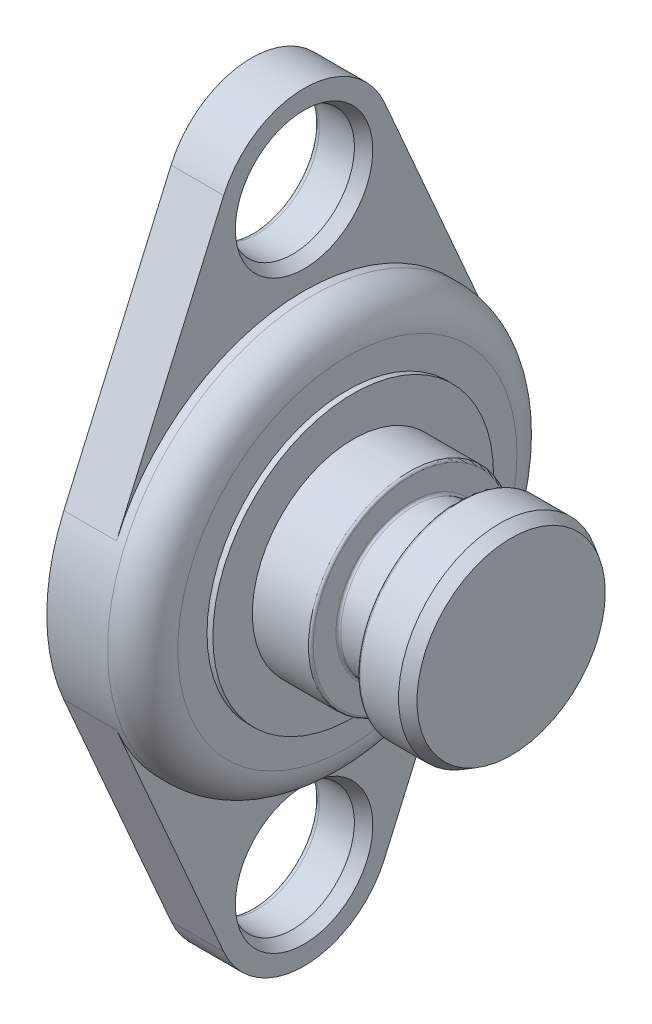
ISO-10303-21;
HEADER;
FILE_DESCRIPTION(('STEP AP214'),'2;1');
FILE_NAME('part.step','',(''),(''),'','','');
FILE_SCHEMA(('AUTOMOTIVE_DESIGN { 1 0 10303 214 1 1 1 1 }'));
ENDSEC;
DATA;
#1=APPLICATION_CONTEXT('core data for automotive mechanical design processes');
#2=APPLICATION_PROTOCOL_DEFINITION('international standard','automotive_design',2000,#1);
#3=PRODUCT_CONTEXT('',#1,'mechanical');
#4=PRODUCT('Part','Part','',(#3));
#5=PRODUCT_RELATED_PRODUCT_CATEGORY('part','',(#4));
#6=PRODUCT_DEFINITION_FORMATION('','',#4);
#7=PRODUCT_DEFINITION_CONTEXT('part definition',#1,'design');
#8=PRODUCT_DEFINITION('design','',#6,#7);
#9=PRODUCT_DEFINITION_SHAPE('','',#8);
#10=(LENGTH_UNIT() NAMED_UNIT(*) SI_UNIT(.MILLI.,.METRE.));
#11=(NAMED_UNIT(*) PLANE_ANGLE_UNIT() SI_UNIT($,.RADIAN.));
#12=(NAMED_UNIT(*) SI_UNIT($,.STERADIAN.) SOLID_ANGLE_UNIT());
#13=UNCERTAINTY_MEASURE_WITH_UNIT(LENGTH_MEASURE(1.E-05),#10,'distance_accuracy_value','');
#14=(GEOMETRIC_REPRESENTATION_CONTEXT(3) GLOBAL_UNCERTAINTY_ASSIGNED_CONTEXT((#13)) GLOBAL_UNIT_ASSIGNED_CONTEXT((#10,
#11,#12)) REPRESENTATION_CONTEXT('',''));
#15=CARTESIAN_POINT('',(0.,0.,0.));
#16=DIRECTION('',(0.,0.,1.));
#17=DIRECTION('',(1.,0.,0.));
#18=AXIS2_PLACEMENT_3D('',#15,#16,#17);
#19=CARTESIAN_POINT('',(0.,0.,0.));
#20=DIRECTION('',(1.,0.,0.));
#21=DIRECTION('',(0.,0.,-1.));
#22=AXIS2_PLACEMENT_3D('',#19,#20,#21);
#23=CYLINDRICAL_SURFACE('',#22,17.5);
#24=CARTESIAN_POINT('',(-17.7,0.,0.));
#25=DIRECTION('',(1.,0.,0.));
#26=DIRECTION('',(0.,0.,-1.));
#27=AXIS2_PLACEMENT_3D('',#24,#25,#26);
#28=CIRCLE('',#27,17.5);
#29=CARTESIAN_POINT('',(-17.7,7.,-16.0390149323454));
#30=VERTEX_POINT('',#29);
#31=CARTESIAN_POINT('',(-17.7,7.,16.0390149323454));
#32=VERTEX_POINT('',#31);
#33=EDGE_CURVE('E199',#30,#32,#28,.T.);
#34=ORIENTED_EDGE('',*,*,#33,.T.);
#35=DIRECTION('',(1.,0.,0.));
#36=VECTOR('',#35,1.);
#37=CARTESIAN_POINT('',(-22.2,7.,16.0390149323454));
#38=LINE('',#37,#36);
#39=CARTESIAN_POINT('',(-22.2,7.,16.0390149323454));
#40=VERTEX_POINT('',#39);
#41=EDGE_CURVE('E153',#40,#32,#38,.T.);
#42=ORIENTED_EDGE('',*,*,#41,.F.);
#43=CARTESIAN_POINT('',(-22.2,0.,0.));
#44=DIRECTION('',(-1.,0.,0.));
#45=DIRECTION('',(0.,0.,1.));
#46=AXIS2_PLACEMENT_3D('',#43,#44,#45);
#47=CIRCLE('',#46,17.5);
#48=CARTESIAN_POINT('',(-22.2,-7.00000000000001,16.0390149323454));
#49=VERTEX_POINT('',#48);
#50=EDGE_CURVE('E219',#49,#40,#47,.T.);
#51=ORIENTED_EDGE('',*,*,#50,.F.);
#52=DIRECTION('',(1.,0.,0.));
#53=VECTOR('',#52,1.);
#54=CARTESIAN_POINT('',(-22.2,-7.00000000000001,16.0390149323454));
#55=LINE('',#54,#53);
#56=CARTESIAN_POINT('',(-17.7,-7.00000000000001,16.0390149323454));
#57=VERTEX_POINT('',#56);
#58=EDGE_CURVE('E135',#49,#57,#55,.T.);
#59=ORIENTED_EDGE('',*,*,#58,.T.);
#60=CARTESIAN_POINT('',(-17.7,-7.,-16.0390149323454));
#61=VERTEX_POINT('',#60);
#62=EDGE_CURVE('E91',#57,#61,#28,.T.);
#63=ORIENTED_EDGE('',*,*,#62,.T.);
#64=DIRECTION('',(1.,0.,0.));
#65=VECTOR('',#64,1.);
#66=CARTESIAN_POINT('',(-22.2,-7.,-16.0390149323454));
#67=LINE('',#66,#65);
#68=CARTESIAN_POINT('',(-22.2,-7.,-16.0390149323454));
#69=VERTEX_POINT('',#68);
#70=EDGE_CURVE('E129',#69,#61,#67,.T.);
#71=ORIENTED_EDGE('',*,*,#70,.F.);
#72=CARTESIAN_POINT('',(-22.2,0.,0.));
#73=DIRECTION('',(-1.,0.,0.));
#74=DIRECTION('',(0.,0.,1.));
#75=AXIS2_PLACEMENT_3D('',#72,#73,#74);
#76=CIRCLE('',#75,17.5);
#77=CARTESIAN_POINT('',(-22.2,7.,-16.0390149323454));
#78=VERTEX_POINT('',#77);
#79=EDGE_CURVE('E119',#78,#69,#76,.T.);
#80=ORIENTED_EDGE('',*,*,#79,.F.);
#81=DIRECTION('',(1.,0.,0.));
#82=VECTOR('',#81,1.);
#83=CARTESIAN_POINT('',(-22.2,7.,-16.0390149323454));
#84=LINE('',#83,#82);
#85=EDGE_CURVE('E52',#78,#30,#84,.T.);
#86=ORIENTED_EDGE('',*,*,#85,.T.);
#87=EDGE_LOOP('',(#34,#42,#51,#59,#63,#71,#80,#86));
#88=FACE_BOUND('',#87,.T.);
#89=CARTESIAN_POINT('',(-17.,0.,0.));
#90=DIRECTION('',(1.,0.,0.));
#91=DIRECTION('',(0.,0.,-1.));
#92=AXIS2_PLACEMENT_3D('',#89,#90,#91);
#93=CIRCLE('',#92,17.5);
#94=CARTESIAN_POINT('',(-17.,0.,-17.5));
#95=VERTEX_POINT('',#94);
#96=EDGE_CURVE('E196',#95,#95,#93,.T.);
#97=ORIENTED_EDGE('',*,*,#96,.F.);
#98=EDGE_LOOP('',(#97));
#99=FACE_BOUND('',#98,.T.);
#100=ADVANCED_FACE('F37',(#88,#99),#23,.T.);
#101=CARTESIAN_POINT('',(-17.,0.,0.));
#102=DIRECTION('',(1.,0.,0.));
#103=DIRECTION('',(0.,0.,-1.));
#104=AXIS2_PLACEMENT_3D('',#101,#102,#103);
#105=TOROIDAL_SURFACE('',#104,14.5,3.);
#106=ORIENTED_EDGE('',*,*,#96,.T.);
#107=EDGE_LOOP('',(#106));
#108=FACE_BOUND('',#107,.T.);
#109=CARTESIAN_POINT('',(-14.,0.,0.));
#110=DIRECTION('',(1.,0.,0.));
#111=DIRECTION('',(0.,0.,-1.));
#112=AXIS2_PLACEMENT_3D('',#109,#110,#111);
#113=CIRCLE('',#112,14.5);
#114=CARTESIAN_POINT('',(-14.,0.,-14.5));
#115=VERTEX_POINT('',#114);
#116=EDGE_CURVE('E193',#115,#115,#113,.T.);
#117=ORIENTED_EDGE('',*,*,#116,.F.);
#118=EDGE_LOOP('',(#117));
#119=FACE_BOUND('',#118,.T.);
#120=ADVANCED_FACE('F289',(#108,#119),#105,.T.);
#121=CARTESIAN_POINT('',(-14.,0.,-12.));
#122=DIRECTION('',(1.,0.,0.));
#123=DIRECTION('',(0.,0.,-1.));
#124=AXIS2_PLACEMENT_3D('',#121,#122,#123);
#125=PLANE('',#124);
#126=ORIENTED_EDGE('',*,*,#116,.T.);
#127=EDGE_LOOP('',(#126));
#128=FACE_BOUND('',#127,.T.);
#129=CARTESIAN_POINT('',(-14.,0.,0.));
#130=DIRECTION('',(1.,0.,0.));
#131=DIRECTION('',(0.,0.,-1.));
#132=AXIS2_PLACEMENT_3D('',#129,#130,#131);
#133=CIRCLE('',#132,12.);
#134=CARTESIAN_POINT('',(-14.,0.,-12.));
#135=VERTEX_POINT('',#134);
#136=EDGE_CURVE('E190',#135,#135,#133,.T.);
#137=ORIENTED_EDGE('',*,*,#136,.F.);
#138=EDGE_LOOP('',(#137));
#139=FACE_BOUND('',#138,.T.);
#140=ADVANCED_FACE('F294',(#128,#139),#125,.T.);
#141=CARTESIAN_POINT('',(0.,0.,0.));
#142=DIRECTION('',(1.,0.,0.));
#143=DIRECTION('',(0.,0.,-1.));
#144=AXIS2_PLACEMENT_3D('',#141,#142,#143);
#145=CYLINDRICAL_SURFACE('',#144,12.);
#146=ORIENTED_EDGE('',*,*,#136,.T.);
#147=EDGE_LOOP('',(#146));
#148=FACE_BOUND('',#147,.T.);
#149=CARTESIAN_POINT('',(-13.5,0.,0.));
#150=DIRECTION('',(1.,0.,0.));
#151=DIRECTION('',(0.,0.,-1.));
#152=AXIS2_PLACEMENT_3D('',#149,#150,#151);
#153=CIRCLE('',#152,12.);
#154=CARTESIAN_POINT('',(-13.5,0.,-12.));
#155=VERTEX_POINT('',#154);
#156=EDGE_CURVE('E187',#155,#155,#153,.T.);
#157=ORIENTED_EDGE('',*,*,#156,.F.);
#158=EDGE_LOOP('',(#157));
#159=FACE_BOUND('',#158,.T.);
#160=ADVANCED_FACE('F388',(#148,#159),#145,.T.);
#161=CARTESIAN_POINT('',(-13.5,0.,-8.625));
#162=DIRECTION('',(1.,0.,0.));
#163=DIRECTION('',(0.,0.,-1.));
#164=AXIS2_PLACEMENT_3D('',#161,#162,#163);
#165=PLANE('',#164);
#166=ORIENTED_EDGE('',*,*,#156,.T.);
#167=EDGE_LOOP('',(#166));
#168=FACE_BOUND('',#167,.T.);
#169=CARTESIAN_POINT('',(-13.5,0.,0.));
#170=DIRECTION('',(1.,0.,0.));
#171=DIRECTION('',(0.,0.,-1.));
#172=AXIS2_PLACEMENT_3D('',#169,#170,#171);
#173=CIRCLE('',#172,8.625);
#174=CARTESIAN_POINT('',(-13.5,0.,-8.625));
#175=VERTEX_POINT('',#174);
#176=EDGE_CURVE('E184',#175,#175,#173,.T.);
#177=ORIENTED_EDGE('',*,*,#176,.F.);
#178=EDGE_LOOP('',(#177));
#179=FACE_BOUND('',#178,.T.);
#180=ADVANCED_FACE('F384',(#168,#179),#165,.T.);
#181=CARTESIAN_POINT('',(0.,0.,0.));
#182=DIRECTION('',(1.,0.,0.));
#183=DIRECTION('',(0.,0.,-1.));
#184=AXIS2_PLACEMENT_3D('',#181,#182,#183);
#185=CYLINDRICAL_SURFACE('',#184,8.625);
#186=ORIENTED_EDGE('',*,*,#176,.T.);
#187=EDGE_LOOP('',(#186));
#188=FACE_BOUND('',#187,.T.);
#189=CARTESIAN_POINT('',(-8.7,0.,0.));
#190=DIRECTION('',(1.,0.,0.));
#191=DIRECTION('',(0.,0.,-1.));
#192=AXIS2_PLACEMENT_3D('',#189,#190,#191);
#193=CIRCLE('',#192,8.625);
#194=CARTESIAN_POINT('',(-8.7,0.,-8.625));
#195=VERTEX_POINT('',#194);
#196=EDGE_CURVE('E181',#195,#195,#193,.T.);
#197=ORIENTED_EDGE('',*,*,#196,.F.);
#198=EDGE_LOOP('',(#197));
#199=FACE_BOUND('',#198,.T.);
#200=ADVANCED_FACE('F380',(#188,#199),#185,.T.);
#201=CARTESIAN_POINT('',(-8.69999999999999,0.,0.));
#202=DIRECTION('',(1.,0.,0.));
#203=DIRECTION('',(0.,0.,-1.));
#204=AXIS2_PLACEMENT_3D('',#201,#202,#203);
#205=TOROIDAL_SURFACE('',#204,8.425,0.200000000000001);
#206=ORIENTED_EDGE('',*,*,#196,.T.);
#207=EDGE_LOOP('',(#206));
#208=FACE_BOUND('',#207,.T.);
#209=CARTESIAN_POINT('',(-8.49999999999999,0.,0.));
#210=DIRECTION('',(1.,0.,0.));
#211=DIRECTION('',(0.,0.,-1.));
#212=AXIS2_PLACEMENT_3D('',#209,#210,#211);
#213=CIRCLE('',#212,8.425);
#214=CARTESIAN_POINT('',(-8.49999999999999,0.,-8.425));
#215=VERTEX_POINT('',#214);
#216=EDGE_CURVE('E178',#215,#215,#213,.T.);
#217=ORIENTED_EDGE('',*,*,#216,.F.);
#218=EDGE_LOOP('',(#217));
#219=FACE_BOUND('',#218,.T.);
#220=ADVANCED_FACE('F376',(#208,#219),#205,.T.);
#221=CARTESIAN_POINT('',(-8.49999999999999,0.,-6.475));
#222=DIRECTION('',(1.,0.,0.));
#223=DIRECTION('',(0.,0.,-1.));
#224=AXIS2_PLACEMENT_3D('',#221,#222,#223);
#225=PLANE('',#224);
#226=ORIENTED_EDGE('',*,*,#216,.T.);
#227=EDGE_LOOP('',(#226));
#228=FACE_BOUND('',#227,.T.);
#229=CARTESIAN_POINT('',(-8.49999999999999,0.,0.));
#230=DIRECTION('',(1.,0.,0.));
#231=DIRECTION('',(0.,0.,-1.));
#232=AXIS2_PLACEMENT_3D('',#229,#230,#231);
#233=CIRCLE('',#232,6.475);
#234=CARTESIAN_POINT('',(-8.49999999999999,0.,-6.475));
#235=VERTEX_POINT('',#234);
#236=EDGE_CURVE('E175',#235,#235,#233,.T.);
#237=ORIENTED_EDGE('',*,*,#236,.F.);
#238=EDGE_LOOP('',(#237));
#239=FACE_BOUND('',#238,.T.);
#240=ADVANCED_FACE('F372',(#228,#239),#225,.T.);
#241=CARTESIAN_POINT('',(-8.29999999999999,0.,0.));
#242=DIRECTION('',(1.,0.,0.));
#243=DIRECTION('',(0.,0.,-1.));
#244=AXIS2_PLACEMENT_3D('',#241,#242,#243);
#245=TOROIDAL_SURFACE('',#244,6.475,0.2);
#246=ORIENTED_EDGE('',*,*,#236,.T.);
#247=EDGE_LOOP('',(#246));
#248=FACE_BOUND('',#247,.T.);
#249=CARTESIAN_POINT('',(-8.29999999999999,0.,0.));
#250=DIRECTION('',(1.,0.,0.));
#251=DIRECTION('',(0.,0.,-1.));
#252=AXIS2_PLACEMENT_3D('',#249,#250,#251);
#253=CIRCLE('',#252,6.275);
#254=CARTESIAN_POINT('',(-8.29999999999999,0.,-6.275));
#255=VERTEX_POINT('',#254);
#256=EDGE_CURVE('E172',#255,#255,#253,.T.);
#257=ORIENTED_EDGE('',*,*,#256,.F.);
#258=EDGE_LOOP('',(#257));
#259=FACE_BOUND('',#258,.T.);
#260=ADVANCED_FACE('F368',(#248,#259),#245,.F.);
#261=CARTESIAN_POINT('',(0.,0.,0.));
#262=DIRECTION('',(1.,0.,0.));
#263=DIRECTION('',(0.,0.,-1.));
#264=AXIS2_PLACEMENT_3D('',#261,#262,#263);
#265=CYLINDRICAL_SURFACE('',#264,6.275);
#266=ORIENTED_EDGE('',*,*,#256,.T.);
#267=EDGE_LOOP('',(#266));
#268=FACE_BOUND('',#267,.T.);
#269=CARTESIAN_POINT('',(-4.7,0.,0.));
#270=DIRECTION('',(1.,0.,0.));
#271=DIRECTION('',(0.,0.,-1.));
#272=AXIS2_PLACEMENT_3D('',#269,#270,#271);
#273=CIRCLE('',#272,6.275);
#274=CARTESIAN_POINT('',(-4.7,0.,-6.275));
#275=VERTEX_POINT('',#274);
#276=EDGE_CURVE('E169',#275,#275,#273,.T.);
#277=ORIENTED_EDGE('',*,*,#276,.F.);
#278=EDGE_LOOP('',(#277));
#279=FACE_BOUND('',#278,.T.);
#280=ADVANCED_FACE('F364',(#268,#279),#265,.T.);
#281=CARTESIAN_POINT('',(-4.7,0.,0.));
#282=DIRECTION('',(1.,0.,0.));
#283=DIRECTION('',(0.,0.,-1.));
#284=AXIS2_PLACEMENT_3D('',#281,#282,#283);
#285=TOROIDAL_SURFACE('',#284,6.475,0.2);
#286=ORIENTED_EDGE('',*,*,#276,.T.);
#287=EDGE_LOOP('',(#286));
#288=FACE_BOUND('',#287,.T.);
#289=CARTESIAN_POINT('',(-4.5,0.,0.));
#290=DIRECTION('',(1.,0.,0.));
#291=DIRECTION('',(0.,0.,-1.));
#292=AXIS2_PLACEMENT_3D('',#289,#290,#291);
#293=CIRCLE('',#292,6.475);
#294=CARTESIAN_POINT('',(-4.5,0.,-6.475));
#295=VERTEX_POINT('',#294);
#296=EDGE_CURVE('E166',#295,#295,#293,.T.);
#297=ORIENTED_EDGE('',*,*,#296,.F.);
#298=EDGE_LOOP('',(#297));
#299=FACE_BOUND('',#298,.T.);
#300=ADVANCED_FACE('F360',(#288,#299),#285,.F.);
#301=CARTESIAN_POINT('',(-4.5,0.,-8.425));
#302=DIRECTION('',(-1.,0.,0.));
#303=DIRECTION('',(0.,0.,1.));
#304=AXIS2_PLACEMENT_3D('',#301,#302,#303);
#305=PLANE('',#304);
#306=ORIENTED_EDGE('',*,*,#296,.T.);
#307=EDGE_LOOP('',(#306));
#308=FACE_BOUND('',#307,.T.);
#309=CARTESIAN_POINT('',(-4.5,0.,0.));
#310=DIRECTION('',(1.,0.,0.));
#311=DIRECTION('',(0.,0.,-1.));
#312=AXIS2_PLACEMENT_3D('',#309,#310,#311);
#313=CIRCLE('',#312,8.425);
#314=CARTESIAN_POINT('',(-4.5,0.,-8.425));
#315=VERTEX_POINT('',#314);
#316=EDGE_CURVE('E163',#315,#315,#313,.T.);
#317=ORIENTED_EDGE('',*,*,#316,.F.);
#318=EDGE_LOOP('',(#317));
#319=FACE_BOUND('',#318,.T.);
#320=ADVANCED_FACE('F356',(#308,#319),#305,.T.);
#321=CARTESIAN_POINT('',(-4.3,0.,0.));
#322=DIRECTION('',(1.,0.,0.));
#323=DIRECTION('',(0.,0.,-1.));
#324=AXIS2_PLACEMENT_3D('',#321,#322,#323);
#325=TOROIDAL_SURFACE('',#324,8.425,0.2);
#326=ORIENTED_EDGE('',*,*,#316,.T.);
#327=EDGE_LOOP('',(#326));
#328=FACE_BOUND('',#327,.T.);
#329=CARTESIAN_POINT('',(-4.3,0.,0.));
#330=DIRECTION('',(1.,0.,0.));
#331=DIRECTION('',(0.,0.,-1.));
#332=AXIS2_PLACEMENT_3D('',#329,#330,#331);
#333=CIRCLE('',#332,8.625);
#334=CARTESIAN_POINT('',(-4.3,0.,-8.625));
#335=VERTEX_POINT('',#334);
#336=EDGE_CURVE('E160',#335,#335,#333,.T.);
#337=ORIENTED_EDGE('',*,*,#336,.F.);
#338=EDGE_LOOP('',(#337));
#339=FACE_BOUND('',#338,.T.);
#340=ADVANCED_FACE('F352',(#328,#339),#325,.T.);
#341=CARTESIAN_POINT('',(0.,0.,0.));
#342=DIRECTION('',(1.,0.,0.));
#343=DIRECTION('',(0.,0.,-1.));
#344=AXIS2_PLACEMENT_3D('',#341,#342,#343);
#345=CYLINDRICAL_SURFACE('',#344,8.625);
#346=ORIENTED_EDGE('',*,*,#336,.T.);
#347=EDGE_LOOP('',(#346));
#348=FACE_BOUND('',#347,.T.);
#349=CARTESIAN_POINT('',(-1.,0.,0.));
#350=DIRECTION('',(1.,0.,0.));
#351=DIRECTION('',(0.,0.,-1.));
#352=AXIS2_PLACEMENT_3D('',#349,#350,#351);
#353=CIRCLE('',#352,8.625);
#354=CARTESIAN_POINT('',(-1.,0.,-8.625));
#355=VERTEX_POINT('',#354);
#356=EDGE_CURVE('E157',#355,#355,#353,.T.);
#357=ORIENTED_EDGE('',*,*,#356,.F.);
#358=EDGE_LOOP('',(#357));
#359=FACE_BOUND('',#358,.T.);
#360=ADVANCED_FACE('F348',(#348,#359),#345,.T.);
#361=CARTESIAN_POINT('',(0.,0.,0.));
#362=DIRECTION('',(-1.,0.,0.));
#363=DIRECTION('',(0.,0.,1.));
#364=AXIS2_PLACEMENT_3D('',#361,#362,#363);
#365=CONICAL_SURFACE('',#364,8.04764973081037,0.523598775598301);
#366=ORIENTED_EDGE('',*,*,#356,.T.);
#367=EDGE_LOOP('',(#366));
#368=FACE_BOUND('',#367,.T.);
#369=CARTESIAN_POINT('',(0.,0.,0.));
#370=DIRECTION('',(1.,0.,0.));
#371=DIRECTION('',(0.,0.,-1.));
#372=AXIS2_PLACEMENT_3D('',#369,#370,#371);
#373=CIRCLE('',#372,8.04764973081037);
#374=CARTESIAN_POINT('',(0.,0.,-8.04764973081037));
#375=VERTEX_POINT('',#374);
#376=EDGE_CURVE('E154',#375,#375,#373,.T.);
#377=ORIENTED_EDGE('',*,*,#376,.F.);
#378=EDGE_LOOP('',(#377));
#379=FACE_BOUND('',#378,.T.);
#380=ADVANCED_FACE('F344',(#368,#379),#365,.T.);
#381=CARTESIAN_POINT('',(0.,0.,0.));
#382=DIRECTION('',(1.,0.,0.));
#383=DIRECTION('',(0.,0.,-1.));
#384=AXIS2_PLACEMENT_3D('',#381,#382,#383);
#385=PLANE('',#384);
#386=ORIENTED_EDGE('',*,*,#376,.T.);
#387=EDGE_LOOP('',(#386));
#388=FACE_BOUND('',#387,.T.);
#389=ADVANCED_FACE('F286',(#388),#385,.T.);
#390=CARTESIAN_POINT('',(-17.7,0.,0.));
#391=DIRECTION('',(-1.,0.,0.));
#392=DIRECTION('',(0.,0.,1.));
#393=AXIS2_PLACEMENT_3D('',#390,#391,#392);
#394=PLANE('',#393);
#395=CARTESIAN_POINT('',(-17.7,25.,0.));
#396=DIRECTION('',(-1.,0.,0.));
#397=DIRECTION('',(0.,0.,1.));
#398=AXIS2_PLACEMENT_3D('',#395,#396,#397);
#399=CIRCLE('',#398,5.87735026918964);
#400=CARTESIAN_POINT('',(-17.7,25.,5.87735026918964));
#401=VERTEX_POINT('',#400);
#402=EDGE_CURVE('E201',#401,#401,#399,.T.);
#403=ORIENTED_EDGE('',*,*,#402,.T.);
#404=EDGE_LOOP('',(#403));
#405=FACE_BOUND('',#404,.T.);
#406=ORIENTED_EDGE('',*,*,#33,.F.);
#407=DIRECTION('',(0.,-0.916515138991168,-0.4));
#408=VECTOR('',#407,1.);
#409=CARTESIAN_POINT('',(-17.7,28.,-6.87386354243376));
#410=LINE('',#409,#408);
#411=CARTESIAN_POINT('',(-17.7,28.,-6.87386354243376));
#412=VERTEX_POINT('',#411);
#413=EDGE_CURVE('E141',#412,#30,#410,.T.);
#414=ORIENTED_EDGE('',*,*,#413,.F.);
#415=CARTESIAN_POINT('',(-17.7,25.,0.));
#416=DIRECTION('',(-1.,0.,0.));
#417=DIRECTION('',(0.,0.,1.));
#418=AXIS2_PLACEMENT_3D('',#415,#416,#417);
#419=CIRCLE('',#418,7.5);
#420=CARTESIAN_POINT('',(-17.7,28.,6.87386354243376));
#421=VERTEX_POINT('',#420);
#422=EDGE_CURVE('E139',#421,#412,#419,.T.);
#423=ORIENTED_EDGE('',*,*,#422,.F.);
#424=DIRECTION('',(0.,0.916515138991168,-0.4));
#425=VECTOR('',#424,1.);
#426=CARTESIAN_POINT('',(-17.7,28.,6.87386354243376));
#427=LINE('',#426,#425);
#428=EDGE_CURVE('E142',#32,#421,#427,.T.);
#429=ORIENTED_EDGE('',*,*,#428,.F.);
#430=EDGE_LOOP('',(#406,#414,#423,#429));
#431=FACE_BOUND('',#430,.T.);
#432=ADVANCED_FACE('F276',(#405,#431),#394,.F.);
#433=CARTESIAN_POINT('',(-22.2,0.,0.));
#434=DIRECTION('',(-1.,0.,0.));
#435=DIRECTION('',(0.,0.,1.));
#436=AXIS2_PLACEMENT_3D('',#433,#434,#435);
#437=PLANE('',#436);
#438=CARTESIAN_POINT('',(-22.2,-25.,0.));
#439=DIRECTION('',(-1.,0.,0.));
#440=DIRECTION('',(0.,0.,1.));
#441=AXIS2_PLACEMENT_3D('',#438,#439,#440);
#442=CIRCLE('',#441,5.8);
#443=CARTESIAN_POINT('',(-22.2,-25.,5.8));
#444=VERTEX_POINT('',#443);
#445=EDGE_CURVE('E45',#444,#444,#442,.F.);
#446=ORIENTED_EDGE('',*,*,#445,.T.);
#447=EDGE_LOOP('',(#446));
#448=FACE_BOUND('',#447,.T.);
#449=CARTESIAN_POINT('',(-22.2,25.,0.));
#450=DIRECTION('',(-1.,0.,0.));
#451=DIRECTION('',(0.,0.,1.));
#452=AXIS2_PLACEMENT_3D('',#449,#450,#451);
#453=CIRCLE('',#452,5.8);
#454=CARTESIAN_POINT('',(-22.2,25.,5.8));
#455=VERTEX_POINT('',#454);
#456=EDGE_CURVE('E246',#455,#455,#453,.F.);
#457=ORIENTED_EDGE('',*,*,#456,.T.);
#458=EDGE_LOOP('',(#457));
#459=FACE_BOUND('',#458,.T.);
#460=ORIENTED_EDGE('',*,*,#50,.T.);
#461=DIRECTION('',(0.,0.916515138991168,-0.4));
#462=VECTOR('',#461,1.);
#463=CARTESIAN_POINT('',(-22.2,28.,6.87386354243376));
#464=LINE('',#463,#462);
#465=CARTESIAN_POINT('',(-22.2,28.,6.87386354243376));
#466=VERTEX_POINT('',#465);
#467=EDGE_CURVE('E100',#40,#466,#464,.T.);
#468=ORIENTED_EDGE('',*,*,#467,.T.);
#469=CARTESIAN_POINT('',(-22.2,25.,0.));
#470=DIRECTION('',(-1.,0.,0.));
#471=DIRECTION('',(0.,0.,1.));
#472=AXIS2_PLACEMENT_3D('',#469,#470,#471);
#473=CIRCLE('',#472,7.5);
#474=CARTESIAN_POINT('',(-22.2,28.,-6.87386354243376));
#475=VERTEX_POINT('',#474);
#476=EDGE_CURVE('E316',#466,#475,#473,.T.);
#477=ORIENTED_EDGE('',*,*,#476,.T.);
#478=DIRECTION('',(0.,-0.916515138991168,-0.4));
#479=VECTOR('',#478,1.);
#480=CARTESIAN_POINT('',(-22.2,28.,-6.87386354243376));
#481=LINE('',#480,#479);
#482=EDGE_CURVE('E318',#475,#78,#481,.T.);
#483=ORIENTED_EDGE('',*,*,#482,.T.);
#484=ORIENTED_EDGE('',*,*,#79,.T.);
#485=DIRECTION('',(0.,-0.916515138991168,0.4));
#486=VECTOR('',#485,1.);
#487=CARTESIAN_POINT('',(-22.2,-7.00000000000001,-16.0390149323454));
#488=LINE('',#487,#486);
#489=CARTESIAN_POINT('',(-22.2,-28.,-6.87386354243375));
#490=VERTEX_POINT('',#489);
#491=EDGE_CURVE('E113',#69,#490,#488,.T.);
#492=ORIENTED_EDGE('',*,*,#491,.T.);
#493=CARTESIAN_POINT('',(-22.2,-25.,0.));
#494=DIRECTION('',(-1.,0.,0.));
#495=DIRECTION('',(0.,0.,1.));
#496=AXIS2_PLACEMENT_3D('',#493,#494,#495);
#497=CIRCLE('',#496,7.5);
#498=CARTESIAN_POINT('',(-22.2,-28.,6.87386354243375));
#499=VERTEX_POINT('',#498);
#500=EDGE_CURVE('E117',#490,#499,#497,.T.);
#501=ORIENTED_EDGE('',*,*,#500,.T.);
#502=DIRECTION('',(0.,0.916515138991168,0.4));
#503=VECTOR('',#502,1.);
#504=CARTESIAN_POINT('',(-22.2,-7.00000000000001,16.0390149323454));
#505=LINE('',#504,#503);
#506=EDGE_CURVE('E61',#499,#49,#505,.T.);
#507=ORIENTED_EDGE('',*,*,#506,.T.);
#508=EDGE_LOOP('',(#460,#468,#477,#483,#484,#492,#501,#507));
#509=FACE_BOUND('',#508,.T.);
#510=ADVANCED_FACE('F115',(#448,#459,#509),#437,.T.);
#511=CARTESIAN_POINT('',(-17.7,-25.,0.));
#512=DIRECTION('',(-1.,0.,0.));
#513=DIRECTION('',(0.,0.,1.));
#514=AXIS2_PLACEMENT_3D('',#511,#512,#513);
#515=CIRCLE('',#514,5.87735026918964);
#516=CARTESIAN_POINT('',(-17.7,-25.,5.87735026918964));
#517=VERTEX_POINT('',#516);
#518=EDGE_CURVE('E237',#517,#517,#515,.T.);
#519=ORIENTED_EDGE('',*,*,#518,.T.);
#520=EDGE_LOOP('',(#519));
#521=FACE_BOUND('',#520,.T.);
#522=ORIENTED_EDGE('',*,*,#62,.F.);
#523=DIRECTION('',(0.,0.916515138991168,0.4));
#524=VECTOR('',#523,1.);
#525=CARTESIAN_POINT('',(-17.7,-7.00000000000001,16.0390149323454));
#526=LINE('',#525,#524);
#527=CARTESIAN_POINT('',(-17.7,-28.,6.87386354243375));
#528=VERTEX_POINT('',#527);
#529=EDGE_CURVE('E145',#528,#57,#526,.T.);
#530=ORIENTED_EDGE('',*,*,#529,.F.);
#531=CARTESIAN_POINT('',(-17.7,-25.,0.));
#532=DIRECTION('',(-1.,0.,0.));
#533=DIRECTION('',(0.,0.,1.));
#534=AXIS2_PLACEMENT_3D('',#531,#532,#533);
#535=CIRCLE('',#534,7.5);
#536=CARTESIAN_POINT('',(-17.7,-28.,-6.87386354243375));
#537=VERTEX_POINT('',#536);
#538=EDGE_CURVE('E143',#537,#528,#535,.T.);
#539=ORIENTED_EDGE('',*,*,#538,.F.);
#540=DIRECTION('',(0.,-0.916515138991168,0.4));
#541=VECTOR('',#540,1.);
#542=CARTESIAN_POINT('',(-17.7,-7.00000000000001,-16.0390149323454));
#543=LINE('',#542,#541);
#544=EDGE_CURVE('E126',#61,#537,#543,.T.);
#545=ORIENTED_EDGE('',*,*,#544,.F.);
#546=EDGE_LOOP('',(#522,#530,#539,#545));
#547=FACE_BOUND('',#546,.T.);
#548=ADVANCED_FACE('F272',(#521,#547),#394,.F.);
#549=CARTESIAN_POINT('',(-22.2,28.,6.87386354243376));
#550=DIRECTION('',(0.,-0.4,-0.916515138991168));
#551=DIRECTION('',(0.,0.916515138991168,-0.4));
#552=AXIS2_PLACEMENT_3D('',#549,#550,#551);
#553=PLANE('',#552);
#554=ORIENTED_EDGE('',*,*,#428,.T.);
#555=DIRECTION('',(1.,0.,0.));
#556=VECTOR('',#555,1.);
#557=CARTESIAN_POINT('',(-22.2,28.,6.87386354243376));
#558=LINE('',#557,#556);
#559=EDGE_CURVE('E150',#466,#421,#558,.T.);
#560=ORIENTED_EDGE('',*,*,#559,.F.);
#561=ORIENTED_EDGE('',*,*,#467,.F.);
#562=ORIENTED_EDGE('',*,*,#41,.T.);
#563=EDGE_LOOP('',(#554,#560,#561,#562));
#564=FACE_BOUND('',#563,.T.);
#565=ADVANCED_FACE('F274',(#564),#553,.F.);
#566=CARTESIAN_POINT('',(-22.2,25.,0.));
#567=DIRECTION('',(1.,0.,0.));
#568=DIRECTION('',(0.,0.,-1.));
#569=AXIS2_PLACEMENT_3D('',#566,#567,#568);
#570=CYLINDRICAL_SURFACE('',#569,7.5);
#571=ORIENTED_EDGE('',*,*,#422,.T.);
#572=DIRECTION('',(1.,0.,0.));
#573=VECTOR('',#572,1.);
#574=CARTESIAN_POINT('',(-22.2,28.,-6.87386354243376));
#575=LINE('',#574,#573);
#576=EDGE_CURVE('E147',#475,#412,#575,.T.);
#577=ORIENTED_EDGE('',*,*,#576,.F.);
#578=ORIENTED_EDGE('',*,*,#476,.F.);
#579=ORIENTED_EDGE('',*,*,#559,.T.);
#580=EDGE_LOOP('',(#571,#577,#578,#579));
#581=FACE_BOUND('',#580,.T.);
#582=ADVANCED_FACE('F281',(#581),#570,.T.);
#583=CARTESIAN_POINT('',(-22.2,28.,-6.87386354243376));
#584=DIRECTION('',(0.,-0.4,0.916515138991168));
#585=DIRECTION('',(0.,-0.916515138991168,-0.4));
#586=AXIS2_PLACEMENT_3D('',#583,#584,#585);
#587=PLANE('',#586);
#588=ORIENTED_EDGE('',*,*,#413,.T.);
#589=ORIENTED_EDGE('',*,*,#85,.F.);
#590=ORIENTED_EDGE('',*,*,#482,.F.);
#591=ORIENTED_EDGE('',*,*,#576,.T.);
#592=EDGE_LOOP('',(#588,#589,#590,#591));
#593=FACE_BOUND('',#592,.T.);
#594=ADVANCED_FACE('F324',(#593),#587,.F.);
#595=CARTESIAN_POINT('',(-22.2,-7.00000000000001,-16.0390149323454));
#596=DIRECTION('',(0.,0.4,0.916515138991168));
#597=DIRECTION('',(0.,-0.916515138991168,0.4));
#598=AXIS2_PLACEMENT_3D('',#595,#596,#597);
#599=PLANE('',#598);
#600=ORIENTED_EDGE('',*,*,#544,.T.);
#601=DIRECTION('',(1.,0.,0.));
#602=VECTOR('',#601,1.);
#603=CARTESIAN_POINT('',(-22.2,-28.,-6.87386354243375));
#604=LINE('',#603,#602);
#605=EDGE_CURVE('E124',#490,#537,#604,.T.);
#606=ORIENTED_EDGE('',*,*,#605,.F.);
#607=ORIENTED_EDGE('',*,*,#491,.F.);
#608=ORIENTED_EDGE('',*,*,#70,.T.);
#609=EDGE_LOOP('',(#600,#606,#607,#608));
#610=FACE_BOUND('',#609,.T.);
#611=ADVANCED_FACE('F125',(#610),#599,.F.);
#612=CARTESIAN_POINT('',(-22.2,-25.,0.));
#613=DIRECTION('',(1.,0.,0.));
#614=DIRECTION('',(0.,0.,-1.));
#615=AXIS2_PLACEMENT_3D('',#612,#613,#614);
#616=CYLINDRICAL_SURFACE('',#615,7.5);
#617=ORIENTED_EDGE('',*,*,#538,.T.);
#618=DIRECTION('',(1.,0.,0.));
#619=VECTOR('',#618,1.);
#620=CARTESIAN_POINT('',(-22.2,-28.,6.87386354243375));
#621=LINE('',#620,#619);
#622=EDGE_CURVE('E130',#499,#528,#621,.T.);
#623=ORIENTED_EDGE('',*,*,#622,.F.);
#624=ORIENTED_EDGE('',*,*,#500,.F.);
#625=ORIENTED_EDGE('',*,*,#605,.T.);
#626=EDGE_LOOP('',(#617,#623,#624,#625));
#627=FACE_BOUND('',#626,.T.);
#628=ADVANCED_FACE('F132',(#627),#616,.T.);
#629=CARTESIAN_POINT('',(-22.2,-7.00000000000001,16.0390149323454));
#630=DIRECTION('',(0.,0.4,-0.916515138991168));
#631=DIRECTION('',(0.,0.916515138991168,0.4));
#632=AXIS2_PLACEMENT_3D('',#629,#630,#631);
#633=PLANE('',#632);
#634=ORIENTED_EDGE('',*,*,#529,.T.);
#635=ORIENTED_EDGE('',*,*,#58,.F.);
#636=ORIENTED_EDGE('',*,*,#506,.F.);
#637=ORIENTED_EDGE('',*,*,#622,.T.);
#638=EDGE_LOOP('',(#634,#635,#636,#637));
#639=FACE_BOUND('',#638,.T.);
#640=ADVANCED_FACE('F326',(#639),#633,.F.);
#641=CARTESIAN_POINT('',(-22.2,25.,0.));
#642=DIRECTION('',(1.,0.,0.));
#643=DIRECTION('',(0.,0.,-1.));
#644=AXIS2_PLACEMENT_3D('',#641,#642,#643);
#645=CYLINDRICAL_SURFACE('',#644,5.3);
#646=CARTESIAN_POINT('',(-21.7,25.,0.));
#647=DIRECTION('',(-1.,0.,0.));
#648=DIRECTION('',(0.,0.,1.));
#649=AXIS2_PLACEMENT_3D('',#646,#647,#648);
#650=CIRCLE('',#649,5.3);
#651=CARTESIAN_POINT('',(-21.7,25.,5.3));
#652=VERTEX_POINT('',#651);
#653=EDGE_CURVE('E11',#652,#652,#650,.T.);
#654=ORIENTED_EDGE('',*,*,#653,.T.);
#655=EDGE_LOOP('',(#654));
#656=FACE_BOUND('',#655,.T.);
#657=CARTESIAN_POINT('',(-18.7,25.,0.));
#658=DIRECTION('',(-1.,0.,0.));
#659=DIRECTION('',(0.,0.,1.));
#660=AXIS2_PLACEMENT_3D('',#657,#658,#659);
#661=CIRCLE('',#660,5.3);
#662=CARTESIAN_POINT('',(-18.7,25.,5.3));
#663=VERTEX_POINT('',#662);
#664=EDGE_CURVE('E234',#663,#663,#661,.F.);
#665=ORIENTED_EDGE('',*,*,#664,.T.);
#666=EDGE_LOOP('',(#665));
#667=FACE_BOUND('',#666,.T.);
#668=ADVANCED_FACE('F263',(#656,#667),#645,.F.);
#669=CARTESIAN_POINT('',(-22.2,-25.,0.));
#670=DIRECTION('',(1.,0.,0.));
#671=DIRECTION('',(0.,0.,-1.));
#672=AXIS2_PLACEMENT_3D('',#669,#670,#671);
#673=CYLINDRICAL_SURFACE('',#672,5.3);
#674=CARTESIAN_POINT('',(-21.7,-25.,0.));
#675=DIRECTION('',(-1.,0.,0.));
#676=DIRECTION('',(0.,0.,1.));
#677=AXIS2_PLACEMENT_3D('',#674,#675,#676);
#678=CIRCLE('',#677,5.3);
#679=CARTESIAN_POINT('',(-21.7,-25.,5.3));
#680=VERTEX_POINT('',#679);
#681=EDGE_CURVE('E243',#680,#680,#678,.T.);
#682=ORIENTED_EDGE('',*,*,#681,.T.);
#683=EDGE_LOOP('',(#682));
#684=FACE_BOUND('',#683,.T.);
#685=CARTESIAN_POINT('',(-18.7,-25.,0.));
#686=DIRECTION('',(-1.,0.,0.));
#687=DIRECTION('',(0.,0.,1.));
#688=AXIS2_PLACEMENT_3D('',#685,#686,#687);
#689=CIRCLE('',#688,5.3);
#690=CARTESIAN_POINT('',(-18.7,-25.,5.3));
#691=VERTEX_POINT('',#690);
#692=EDGE_CURVE('E240',#691,#691,#689,.F.);
#693=ORIENTED_EDGE('',*,*,#692,.T.);
#694=EDGE_LOOP('',(#693));
#695=FACE_BOUND('',#694,.T.);
#696=ADVANCED_FACE('F259',(#684,#695),#673,.F.);
#697=CARTESIAN_POINT('',(-17.7,25.,0.));
#698=DIRECTION('',(1.,0.,0.));
#699=DIRECTION('',(0.,0.,-1.));
#700=AXIS2_PLACEMENT_3D('',#697,#698,#699);
#701=CONICAL_SURFACE('',#700,5.87735026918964,0.523598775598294);
#702=ORIENTED_EDGE('',*,*,#664,.F.);
#703=EDGE_LOOP('',(#702));
#704=FACE_BOUND('',#703,.T.);
#705=ORIENTED_EDGE('',*,*,#402,.F.);
#706=EDGE_LOOP('',(#705));
#707=FACE_BOUND('',#706,.T.);
#708=ADVANCED_FACE('F262',(#704,#707),#701,.F.);
#709=CARTESIAN_POINT('',(-17.7,-25.,0.));
#710=DIRECTION('',(1.,0.,0.));
#711=DIRECTION('',(0.,0.,-1.));
#712=AXIS2_PLACEMENT_3D('',#709,#710,#711);
#713=CONICAL_SURFACE('',#712,5.87735026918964,0.523598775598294);
#714=ORIENTED_EDGE('',*,*,#692,.F.);
#715=EDGE_LOOP('',(#714));
#716=FACE_BOUND('',#715,.T.);
#717=ORIENTED_EDGE('',*,*,#518,.F.);
#718=EDGE_LOOP('',(#717));
#719=FACE_BOUND('',#718,.T.);
#720=ADVANCED_FACE('F256',(#716,#719),#713,.F.);
#721=CARTESIAN_POINT('',(-21.7,-25.,0.));
#722=DIRECTION('',(-1.,0.,0.));
#723=DIRECTION('',(0.,0.,1.));
#724=AXIS2_PLACEMENT_3D('',#721,#722,#723);
#725=TOROIDAL_SURFACE('',#724,5.8,0.5);
#726=ORIENTED_EDGE('',*,*,#445,.F.);
#727=EDGE_LOOP('',(#726));
#728=FACE_BOUND('',#727,.T.);
#729=ORIENTED_EDGE('',*,*,#681,.F.);
#730=EDGE_LOOP('',(#729));
#731=FACE_BOUND('',#730,.T.);
#732=ADVANCED_FACE('F253',(#728,#731),#725,.T.);
#733=CARTESIAN_POINT('',(-21.7,25.,0.));
#734=DIRECTION('',(-1.,0.,0.));
#735=DIRECTION('',(0.,0.,1.));
#736=AXIS2_PLACEMENT_3D('',#733,#734,#735);
#737=TOROIDAL_SURFACE('',#736,5.8,0.5);
#738=ORIENTED_EDGE('',*,*,#456,.F.);
#739=EDGE_LOOP('',(#738));
#740=FACE_BOUND('',#739,.T.);
#741=ORIENTED_EDGE('',*,*,#653,.F.);
#742=EDGE_LOOP('',(#741));
#743=FACE_BOUND('',#742,.T.);
#744=ADVANCED_FACE('F39',(#740,#743),#737,.T.);
#745=CLOSED_SHELL('',(#100,#120,#140,#160,#180,#200,#220,#240,#260,#280,#300,#320,#340,#360,
#380,#389,#432,#510,#548,#565,#582,#594,#611,#628,#640,#668,#696,#708,#720,#732,#744));
#746=MANIFOLD_SOLID_BREP('B2',#745);
#747=ADVANCED_BREP_SHAPE_REPRESENTATION('',(#18,#746),#14);
#748=SHAPE_DEFINITION_REPRESENTATION(#9,#747);
ENDSEC;
END-ISO-10303-21;
